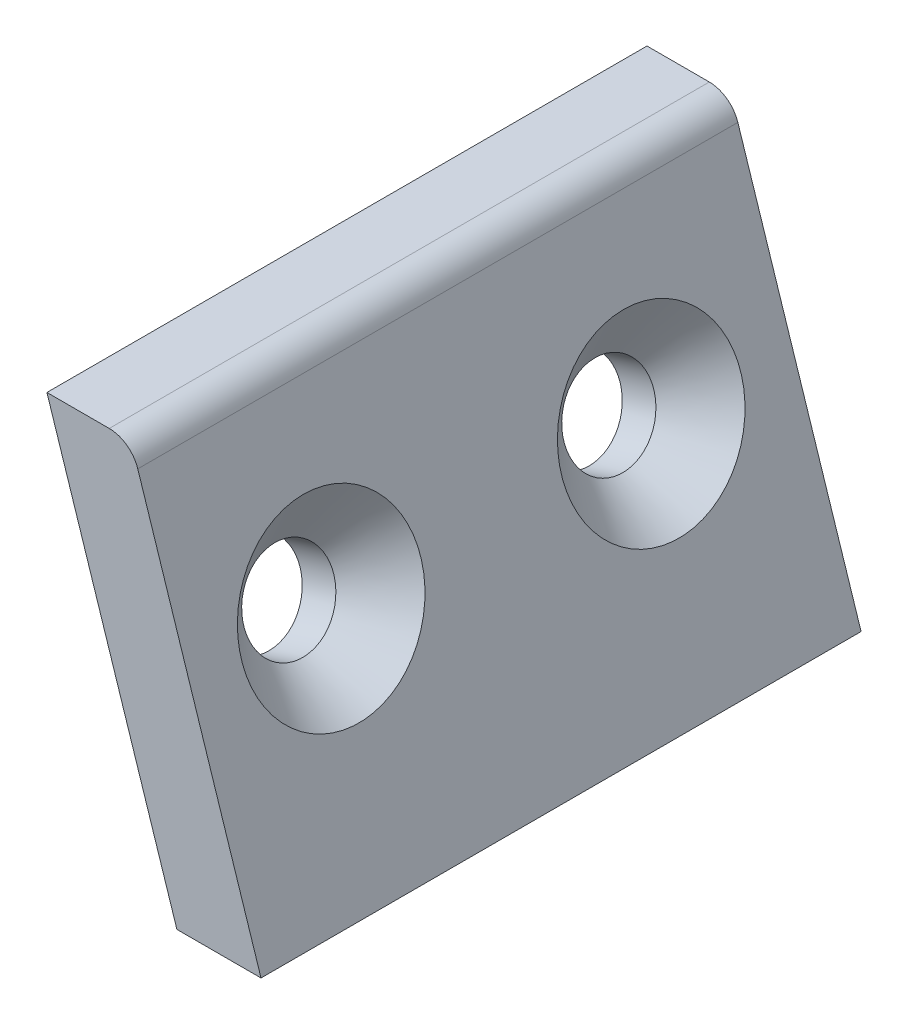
ISO-10303-21;
HEADER;
FILE_DESCRIPTION(('STEP AP214'),'2;1');
FILE_NAME('part.step','',(''),(''),'','','');
FILE_SCHEMA(('AUTOMOTIVE_DESIGN { 1 0 10303 214 1 1 1 1 }'));
ENDSEC;
DATA;
#1=APPLICATION_CONTEXT('core data for automotive mechanical design processes');
#2=APPLICATION_PROTOCOL_DEFINITION('international standard','automotive_design',2000,#1);
#3=PRODUCT_CONTEXT('',#1,'mechanical');
#4=PRODUCT('Part','Part','',(#3));
#5=PRODUCT_RELATED_PRODUCT_CATEGORY('part','',(#4));
#6=PRODUCT_DEFINITION_FORMATION('','',#4);
#7=PRODUCT_DEFINITION_CONTEXT('part definition',#1,'design');
#8=PRODUCT_DEFINITION('design','',#6,#7);
#9=PRODUCT_DEFINITION_SHAPE('','',#8);
#10=(LENGTH_UNIT() NAMED_UNIT(*) SI_UNIT(.MILLI.,.METRE.));
#11=(NAMED_UNIT(*) PLANE_ANGLE_UNIT() SI_UNIT($,.RADIAN.));
#12=(NAMED_UNIT(*) SI_UNIT($,.STERADIAN.) SOLID_ANGLE_UNIT());
#13=UNCERTAINTY_MEASURE_WITH_UNIT(LENGTH_MEASURE(1.E-05),#10,'distance_accuracy_value','');
#14=(GEOMETRIC_REPRESENTATION_CONTEXT(3) GLOBAL_UNCERTAINTY_ASSIGNED_CONTEXT((#13)) GLOBAL_UNIT_ASSIGNED_CONTEXT((#10,
#11,#12)) REPRESENTATION_CONTEXT('',''));
#15=CARTESIAN_POINT('',(0.,0.,0.));
#16=DIRECTION('',(0.,0.,1.));
#17=DIRECTION('',(1.,0.,0.));
#18=AXIS2_PLACEMENT_3D('',#15,#16,#17);
#19=CARTESIAN_POINT('',(35.,-22.,-30.));
#20=DIRECTION('',(0.,0.,-1.));
#21=DIRECTION('',(-1.,0.,0.));
#22=AXIS2_PLACEMENT_3D('',#19,#20,#21);
#23=PLANE('',#22);
#24=DIRECTION('',(-1.,0.,0.));
#25=VECTOR('',#24,1.);
#26=CARTESIAN_POINT('',(56.3198822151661,12.,-30.));
#27=LINE('',#26,#25);
#28=CARTESIAN_POINT('',(59.4359173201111,12.,-30.));
#29=VERTEX_POINT('',#28);
#30=CARTESIAN_POINT('',(56.3198822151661,12.,-30.));
#31=VERTEX_POINT('',#30);
#32=EDGE_CURVE('E86',#29,#31,#27,.T.);
#33=ORIENTED_EDGE('',*,*,#32,.F.);
#34=CARTESIAN_POINT('',(59.4359173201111,10.5,-30.));
#35=DIRECTION('',(0.,0.,-1.));
#36=DIRECTION('',(-1.,0.,0.));
#37=AXIS2_PLACEMENT_3D('',#34,#35,#36);
#38=CIRCLE('',#37,1.5);
#39=CARTESIAN_POINT('',(60.8625020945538,10.9635254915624,-30.));
#40=VERTEX_POINT('',#39);
#41=EDGE_CURVE('E11',#29,#40,#38,.T.);
#42=ORIENTED_EDGE('',*,*,#41,.T.);
#43=DIRECTION('',(-0.309016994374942,0.951056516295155,0.));
#44=VECTOR('',#43,1.);
#45=CARTESIAN_POINT('',(67.0241250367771,-8.,-30.));
#46=LINE('',#45,#44);
#47=CARTESIAN_POINT('',(67.0241250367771,-8.,-30.));
#48=VERTEX_POINT('',#47);
#49=EDGE_CURVE('E76',#48,#40,#46,.T.);
#50=ORIENTED_EDGE('',*,*,#49,.F.);
#51=DIRECTION('',(1.,0.,0.));
#52=VECTOR('',#51,1.);
#53=CARTESIAN_POINT('',(62.8182761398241,-8.,-30.));
#54=LINE('',#53,#52);
#55=CARTESIAN_POINT('',(62.8182761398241,-8.,-30.));
#56=VERTEX_POINT('',#55);
#57=EDGE_CURVE('E80',#56,#48,#54,.T.);
#58=ORIENTED_EDGE('',*,*,#57,.F.);
#59=DIRECTION('',(0.309016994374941,-0.951056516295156,0.));
#60=VECTOR('',#59,1.);
#61=CARTESIAN_POINT('',(62.8182761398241,-8.,-30.));
#62=LINE('',#61,#60);
#63=EDGE_CURVE('E106',#31,#56,#62,.T.);
#64=ORIENTED_EDGE('',*,*,#63,.F.);
#65=EDGE_LOOP('',(#33,#42,#50,#58,#64));
#66=FACE_BOUND('',#65,.T.);
#67=ADVANCED_FACE('F32',(#66),#23,.T.);
#68=CARTESIAN_POINT('',(56.3198822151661,12.,0.));
#69=DIRECTION('',(0.,0.,-1.));
#70=DIRECTION('',(-1.,0.,0.));
#71=AXIS2_PLACEMENT_3D('',#68,#69,#70);
#72=PLANE('',#71);
#73=DIRECTION('',(-0.309016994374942,0.951056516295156,0.));
#74=VECTOR('',#73,1.);
#75=CARTESIAN_POINT('',(67.0241250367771,-8.,0.));
#76=LINE('',#75,#74);
#77=CARTESIAN_POINT('',(67.0241250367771,-8.,0.));
#78=VERTEX_POINT('',#77);
#79=CARTESIAN_POINT('',(60.8625020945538,10.9635254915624,0.));
#80=VERTEX_POINT('',#79);
#81=EDGE_CURVE('E91',#78,#80,#76,.T.);
#82=ORIENTED_EDGE('',*,*,#81,.T.);
#83=CARTESIAN_POINT('',(59.4359173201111,10.5,0.));
#84=DIRECTION('',(0.,0.,-1.));
#85=DIRECTION('',(-1.,0.,0.));
#86=AXIS2_PLACEMENT_3D('',#83,#84,#85);
#87=CIRCLE('',#86,1.5);
#88=CARTESIAN_POINT('',(59.4359173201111,12.,0.));
#89=VERTEX_POINT('',#88);
#90=EDGE_CURVE('E54',#80,#89,#87,.F.);
#91=ORIENTED_EDGE('',*,*,#90,.T.);
#92=DIRECTION('',(-1.,0.,0.));
#93=VECTOR('',#92,1.);
#94=CARTESIAN_POINT('',(56.3198822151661,12.,0.));
#95=LINE('',#94,#93);
#96=CARTESIAN_POINT('',(56.3198822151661,12.,0.));
#97=VERTEX_POINT('',#96);
#98=EDGE_CURVE('E99',#89,#97,#95,.T.);
#99=ORIENTED_EDGE('',*,*,#98,.T.);
#100=DIRECTION('',(0.309016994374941,-0.951056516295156,0.));
#101=VECTOR('',#100,1.);
#102=CARTESIAN_POINT('',(62.8182761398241,-8.,0.));
#103=LINE('',#102,#101);
#104=CARTESIAN_POINT('',(62.8182761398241,-8.,0.));
#105=VERTEX_POINT('',#104);
#106=EDGE_CURVE('E104',#97,#105,#103,.T.);
#107=ORIENTED_EDGE('',*,*,#106,.T.);
#108=DIRECTION('',(1.,0.,0.));
#109=VECTOR('',#108,1.);
#110=CARTESIAN_POINT('',(62.8182761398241,-8.,0.));
#111=LINE('',#110,#109);
#112=EDGE_CURVE('E127',#105,#78,#111,.T.);
#113=ORIENTED_EDGE('',*,*,#112,.T.);
#114=EDGE_LOOP('',(#82,#91,#99,#107,#113));
#115=FACE_BOUND('',#114,.T.);
#116=ADVANCED_FACE('F125',(#115),#72,.F.);
#117=CARTESIAN_POINT('',(62.8182761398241,-8.,-52.6843737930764));
#118=DIRECTION('',(0.,-1.,0.));
#119=DIRECTION('',(0.,0.,-1.));
#120=AXIS2_PLACEMENT_3D('',#117,#118,#119);
#121=PLANE('',#120);
#122=DIRECTION('',(0.,0.,1.));
#123=VECTOR('',#122,1.);
#124=CARTESIAN_POINT('',(62.8182761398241,-8.,-52.6843737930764));
#125=LINE('',#124,#123);
#126=EDGE_CURVE('E98',#56,#105,#125,.T.);
#127=ORIENTED_EDGE('',*,*,#126,.F.);
#128=ORIENTED_EDGE('',*,*,#57,.T.);
#129=DIRECTION('',(0.,0.,1.));
#130=VECTOR('',#129,1.);
#131=CARTESIAN_POINT('',(67.0241250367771,-8.,-52.6843737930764));
#132=LINE('',#131,#130);
#133=EDGE_CURVE('E87',#48,#78,#132,.T.);
#134=ORIENTED_EDGE('',*,*,#133,.T.);
#135=ORIENTED_EDGE('',*,*,#112,.F.);
#136=EDGE_LOOP('',(#127,#128,#134,#135));
#137=FACE_BOUND('',#136,.T.);
#138=ADVANCED_FACE('F97',(#137),#121,.T.);
#139=CARTESIAN_POINT('',(67.0241250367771,-8.,-52.6843737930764));
#140=DIRECTION('',(0.951056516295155,0.309016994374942,0.));
#141=DIRECTION('',(-0.309016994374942,0.951056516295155,0.));
#142=AXIS2_PLACEMENT_3D('',#139,#140,#141);
#143=PLANE('',#142);
#144=CARTESIAN_POINT('',(63.5323322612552,2.74663314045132,-23.));
#145=DIRECTION('',(0.951056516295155,0.309016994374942,0.));
#146=DIRECTION('',(-0.309016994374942,0.951056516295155,0.));
#147=AXIS2_PLACEMENT_3D('',#144,#145,#146);
#148=CIRCLE('',#147,4.48);
#149=CARTESIAN_POINT('',(62.1479361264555,7.00736633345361,-23.));
#150=VERTEX_POINT('',#149);
#151=EDGE_CURVE('E122',#150,#150,#148,.T.);
#152=ORIENTED_EDGE('',*,*,#151,.F.);
#153=EDGE_LOOP('',(#152));
#154=FACE_BOUND('',#153,.T.);
#155=CARTESIAN_POINT('',(63.5323322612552,2.74663314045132,-7.));
#156=DIRECTION('',(0.951056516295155,0.309016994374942,0.));
#157=DIRECTION('',(-0.309016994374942,0.951056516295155,0.));
#158=AXIS2_PLACEMENT_3D('',#155,#156,#157);
#159=CIRCLE('',#158,4.48);
#160=CARTESIAN_POINT('',(62.1479361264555,7.00736633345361,-7.));
#161=VERTEX_POINT('',#160);
#162=EDGE_CURVE('E117',#161,#161,#159,.T.);
#163=ORIENTED_EDGE('',*,*,#162,.F.);
#164=EDGE_LOOP('',(#163));
#165=FACE_BOUND('',#164,.T.);
#166=ORIENTED_EDGE('',*,*,#49,.T.);
#167=DIRECTION('',(0.,0.,1.));
#168=VECTOR('',#167,1.);
#169=CARTESIAN_POINT('',(60.8625020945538,10.9635254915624,-52.6843737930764));
#170=LINE('',#169,#168);
#171=EDGE_CURVE('E113',#40,#80,#170,.T.);
#172=ORIENTED_EDGE('',*,*,#171,.T.);
#173=ORIENTED_EDGE('',*,*,#81,.F.);
#174=ORIENTED_EDGE('',*,*,#133,.F.);
#175=EDGE_LOOP('',(#166,#172,#173,#174));
#176=FACE_BOUND('',#175,.T.);
#177=ADVANCED_FACE('F90',(#154,#165,#176),#143,.T.);
#178=CARTESIAN_POINT('',(56.3198822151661,12.,-52.6843737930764));
#179=DIRECTION('',(0.,1.,0.));
#180=DIRECTION('',(0.,0.,1.));
#181=AXIS2_PLACEMENT_3D('',#178,#179,#180);
#182=PLANE('',#181);
#183=ORIENTED_EDGE('',*,*,#98,.F.);
#184=DIRECTION('',(0.,0.,1.));
#185=VECTOR('',#184,1.);
#186=CARTESIAN_POINT('',(59.4359173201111,12.,-52.6843737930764));
#187=LINE('',#186,#185);
#188=EDGE_CURVE('E40',#89,#29,#187,.F.);
#189=ORIENTED_EDGE('',*,*,#188,.T.);
#190=ORIENTED_EDGE('',*,*,#32,.T.);
#191=DIRECTION('',(0.,0.,1.));
#192=VECTOR('',#191,1.);
#193=CARTESIAN_POINT('',(56.3198822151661,12.,-52.6843737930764));
#194=LINE('',#193,#192);
#195=EDGE_CURVE('E108',#31,#97,#194,.T.);
#196=ORIENTED_EDGE('',*,*,#195,.T.);
#197=EDGE_LOOP('',(#183,#189,#190,#196));
#198=FACE_BOUND('',#197,.T.);
#199=ADVANCED_FACE('F151',(#198),#182,.T.);
#200=CARTESIAN_POINT('',(62.8182761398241,-8.,-52.6843737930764));
#201=DIRECTION('',(-0.951056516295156,-0.309016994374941,0.));
#202=DIRECTION('',(0.309016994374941,-0.951056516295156,0.));
#203=AXIS2_PLACEMENT_3D('',#200,#201,#202);
#204=PLANE('',#203);
#205=CARTESIAN_POINT('',(59.7281061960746,1.51056516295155,-23.));
#206=DIRECTION('',(-0.951056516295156,-0.309016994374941,0.));
#207=DIRECTION('',(0.309016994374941,-0.951056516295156,0.));
#208=AXIS2_PLACEMENT_3D('',#205,#206,#207);
#209=CIRCLE('',#208,2.25);
#210=CARTESIAN_POINT('',(60.4233944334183,-0.629311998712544,-23.));
#211=VERTEX_POINT('',#210);
#212=EDGE_CURVE('E118',#211,#211,#209,.T.);
#213=ORIENTED_EDGE('',*,*,#212,.F.);
#214=EDGE_LOOP('',(#213));
#215=FACE_BOUND('',#214,.T.);
#216=CARTESIAN_POINT('',(59.7281061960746,1.51056516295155,-7.));
#217=DIRECTION('',(-0.951056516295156,-0.309016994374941,0.));
#218=DIRECTION('',(0.309016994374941,-0.951056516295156,0.));
#219=AXIS2_PLACEMENT_3D('',#216,#217,#218);
#220=CIRCLE('',#219,2.25);
#221=CARTESIAN_POINT('',(60.4233944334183,-0.629311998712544,-7.));
#222=VERTEX_POINT('',#221);
#223=EDGE_CURVE('E114',#222,#222,#220,.T.);
#224=ORIENTED_EDGE('',*,*,#223,.F.);
#225=EDGE_LOOP('',(#224));
#226=FACE_BOUND('',#225,.T.);
#227=ORIENTED_EDGE('',*,*,#195,.F.);
#228=ORIENTED_EDGE('',*,*,#63,.T.);
#229=ORIENTED_EDGE('',*,*,#126,.T.);
#230=ORIENTED_EDGE('',*,*,#106,.F.);
#231=EDGE_LOOP('',(#227,#228,#229,#230));
#232=FACE_BOUND('',#231,.T.);
#233=ADVANCED_FACE('F157',(#215,#226,#232),#204,.T.);
#234=CARTESIAN_POINT('',(63.5323322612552,2.74663314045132,-7.));
#235=DIRECTION('',(0.951056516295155,0.309016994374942,0.));
#236=DIRECTION('',(-0.309016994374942,0.951056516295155,0.));
#237=AXIS2_PLACEMENT_3D('',#234,#235,#236);
#238=CONICAL_SURFACE('',#237,4.48,0.785398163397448);
#239=CARTESIAN_POINT('',(61.411476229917,2.05752524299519,-7.));
#240=DIRECTION('',(0.951056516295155,0.309016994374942,0.));
#241=DIRECTION('',(-0.309016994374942,0.951056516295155,0.));
#242=AXIS2_PLACEMENT_3D('',#239,#240,#241);
#243=CIRCLE('',#242,2.25);
#244=CARTESIAN_POINT('',(60.7161879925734,4.19740240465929,-7.));
#245=VERTEX_POINT('',#244);
#246=EDGE_CURVE('E121',#245,#245,#243,.T.);
#247=ORIENTED_EDGE('',*,*,#246,.F.);
#248=EDGE_LOOP('',(#247));
#249=FACE_BOUND('',#248,.T.);
#250=ORIENTED_EDGE('',*,*,#162,.T.);
#251=EDGE_LOOP('',(#250));
#252=FACE_BOUND('',#251,.T.);
#253=ADVANCED_FACE('F155',(#249,#252),#238,.F.);
#254=CARTESIAN_POINT('',(63.5323322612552,2.74663314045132,-7.));
#255=DIRECTION('',(0.951056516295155,0.309016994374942,0.));
#256=DIRECTION('',(-0.309016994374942,0.951056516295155,0.));
#257=AXIS2_PLACEMENT_3D('',#254,#255,#256);
#258=CYLINDRICAL_SURFACE('',#257,2.25);
#259=ORIENTED_EDGE('',*,*,#223,.T.);
#260=EDGE_LOOP('',(#259));
#261=FACE_BOUND('',#260,.T.);
#262=ORIENTED_EDGE('',*,*,#246,.T.);
#263=EDGE_LOOP('',(#262));
#264=FACE_BOUND('',#263,.T.);
#265=ADVANCED_FACE('F145',(#261,#264),#258,.F.);
#266=CARTESIAN_POINT('',(63.5323322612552,2.74663314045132,-23.));
#267=DIRECTION('',(0.951056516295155,0.309016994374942,0.));
#268=DIRECTION('',(-0.309016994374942,0.951056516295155,0.));
#269=AXIS2_PLACEMENT_3D('',#266,#267,#268);
#270=CONICAL_SURFACE('',#269,4.48,0.785398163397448);
#271=CARTESIAN_POINT('',(61.411476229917,2.05752524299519,-23.));
#272=DIRECTION('',(0.951056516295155,0.309016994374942,0.));
#273=DIRECTION('',(-0.309016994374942,0.951056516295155,0.));
#274=AXIS2_PLACEMENT_3D('',#271,#272,#273);
#275=CIRCLE('',#274,2.25);
#276=CARTESIAN_POINT('',(60.7161879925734,4.19740240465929,-23.));
#277=VERTEX_POINT('',#276);
#278=EDGE_CURVE('E136',#277,#277,#275,.T.);
#279=ORIENTED_EDGE('',*,*,#278,.F.);
#280=EDGE_LOOP('',(#279));
#281=FACE_BOUND('',#280,.T.);
#282=ORIENTED_EDGE('',*,*,#151,.T.);
#283=EDGE_LOOP('',(#282));
#284=FACE_BOUND('',#283,.T.);
#285=ADVANCED_FACE('F142',(#281,#284),#270,.F.);
#286=CARTESIAN_POINT('',(63.5323322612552,2.74663314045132,-23.));
#287=DIRECTION('',(0.951056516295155,0.309016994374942,0.));
#288=DIRECTION('',(-0.309016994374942,0.951056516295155,0.));
#289=AXIS2_PLACEMENT_3D('',#286,#287,#288);
#290=CYLINDRICAL_SURFACE('',#289,2.25);
#291=ORIENTED_EDGE('',*,*,#212,.T.);
#292=EDGE_LOOP('',(#291));
#293=FACE_BOUND('',#292,.T.);
#294=ORIENTED_EDGE('',*,*,#278,.T.);
#295=EDGE_LOOP('',(#294));
#296=FACE_BOUND('',#295,.T.);
#297=ADVANCED_FACE('F140',(#293,#296),#290,.F.);
#298=CARTESIAN_POINT('',(59.4359173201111,10.5,-52.6843737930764));
#299=DIRECTION('',(0.,0.,1.));
#300=DIRECTION('',(1.,0.,0.));
#301=AXIS2_PLACEMENT_3D('',#298,#299,#300);
#302=CYLINDRICAL_SURFACE('',#301,1.5);
#303=ORIENTED_EDGE('',*,*,#41,.F.);
#304=ORIENTED_EDGE('',*,*,#188,.F.);
#305=ORIENTED_EDGE('',*,*,#90,.F.);
#306=ORIENTED_EDGE('',*,*,#171,.F.);
#307=EDGE_LOOP('',(#303,#304,#305,#306));
#308=FACE_BOUND('',#307,.T.);
#309=ADVANCED_FACE('F34',(#308),#302,.T.);
#310=CLOSED_SHELL('',(#67,#116,#138,#177,#199,#233,#253,#265,#285,#297,#309));
#311=MANIFOLD_SOLID_BREP('B2',#310);
#312=ADVANCED_BREP_SHAPE_REPRESENTATION('',(#18,#311),#14);
#313=SHAPE_DEFINITION_REPRESENTATION(#9,#312);
ENDSEC;
END-ISO-10303-21;
